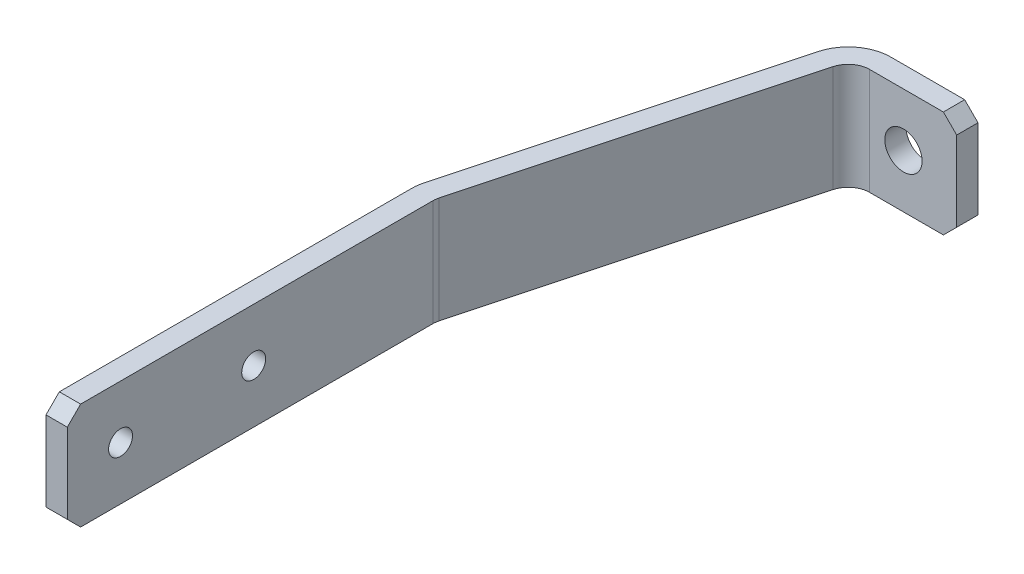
ISO-10303-21;
HEADER;
FILE_DESCRIPTION(('STEP AP214'),'2;1');
FILE_NAME('part.step','',(''),(''),'','','');
FILE_SCHEMA(('AUTOMOTIVE_DESIGN { 1 0 10303 214 1 1 1 1 }'));
ENDSEC;
DATA;
#1=APPLICATION_CONTEXT('core data for automotive mechanical design processes');
#2=APPLICATION_PROTOCOL_DEFINITION('international standard','automotive_design',2000,#1);
#3=PRODUCT_CONTEXT('',#1,'mechanical');
#4=PRODUCT('Part','Part','',(#3));
#5=PRODUCT_RELATED_PRODUCT_CATEGORY('part','',(#4));
#6=PRODUCT_DEFINITION_FORMATION('','',#4);
#7=PRODUCT_DEFINITION_CONTEXT('part definition',#1,'design');
#8=PRODUCT_DEFINITION('design','',#6,#7);
#9=PRODUCT_DEFINITION_SHAPE('','',#8);
#10=(LENGTH_UNIT() NAMED_UNIT(*) SI_UNIT(.MILLI.,.METRE.));
#11=(NAMED_UNIT(*) PLANE_ANGLE_UNIT() SI_UNIT($,.RADIAN.));
#12=(NAMED_UNIT(*) SI_UNIT($,.STERADIAN.) SOLID_ANGLE_UNIT());
#13=UNCERTAINTY_MEASURE_WITH_UNIT(LENGTH_MEASURE(1.E-05),#10,'distance_accuracy_value','');
#14=(GEOMETRIC_REPRESENTATION_CONTEXT(3) GLOBAL_UNCERTAINTY_ASSIGNED_CONTEXT((#13)) GLOBAL_UNIT_ASSIGNED_CONTEXT((#10,
#11,#12)) REPRESENTATION_CONTEXT('',''));
#15=CARTESIAN_POINT('',(0.,0.,0.));
#16=DIRECTION('',(0.,0.,1.));
#17=DIRECTION('',(1.,0.,0.));
#18=AXIS2_PLACEMENT_3D('',#15,#16,#17);
#19=CARTESIAN_POINT('',(80.,20.,8.));
#20=DIRECTION('',(1.,0.,0.));
#21=DIRECTION('',(0.,0.,-1.));
#22=AXIS2_PLACEMENT_3D('',#19,#20,#21);
#23=PLANE('',#22);
#24=DIRECTION('',(0.,0.,1.));
#25=VECTOR('',#24,1.);
#26=CARTESIAN_POINT('',(80.,15.,7.5));
#27=LINE('',#26,#25);
#28=CARTESIAN_POINT('',(80.,15.,8.));
#29=VERTEX_POINT('',#28);
#30=CARTESIAN_POINT('',(80.,15.,0.));
#31=VERTEX_POINT('',#30);
#32=EDGE_CURVE('E264',#29,#31,#27,.F.);
#33=ORIENTED_EDGE('',*,*,#32,.F.);
#34=DIRECTION('',(0.,1.,0.));
#35=VECTOR('',#34,1.);
#36=CARTESIAN_POINT('',(80.,20.,8.));
#37=LINE('',#36,#35);
#38=CARTESIAN_POINT('',(80.,-15.,8.));
#39=VERTEX_POINT('',#38);
#40=EDGE_CURVE('E255',#39,#29,#37,.T.);
#41=ORIENTED_EDGE('',*,*,#40,.F.);
#42=DIRECTION('',(0.,0.,1.));
#43=VECTOR('',#42,1.);
#44=CARTESIAN_POINT('',(80.,-15.,7.5));
#45=LINE('',#44,#43);
#46=CARTESIAN_POINT('',(80.,-15.,0.));
#47=VERTEX_POINT('',#46);
#48=EDGE_CURVE('E256',#47,#39,#45,.T.);
#49=ORIENTED_EDGE('',*,*,#48,.F.);
#50=DIRECTION('',(0.,1.,0.));
#51=VECTOR('',#50,1.);
#52=CARTESIAN_POINT('',(80.,20.,0.));
#53=LINE('',#52,#51);
#54=EDGE_CURVE('E259',#31,#47,#53,.F.);
#55=ORIENTED_EDGE('',*,*,#54,.F.);
#56=EDGE_LOOP('',(#33,#41,#49,#55));
#57=FACE_BOUND('',#56,.T.);
#58=ADVANCED_FACE('F15',(#57),#23,.T.);
#59=CARTESIAN_POINT('',(60.,0.,4.));
#60=DIRECTION('',(0.,0.,1.));
#61=DIRECTION('',(1.,0.,0.));
#62=AXIS2_PLACEMENT_3D('',#59,#60,#61);
#63=CYLINDRICAL_SURFACE('',#62,7.);
#64=CARTESIAN_POINT('',(60.,0.,0.));
#65=DIRECTION('',(0.,0.,1.));
#66=DIRECTION('',(1.,0.,0.));
#67=AXIS2_PLACEMENT_3D('',#64,#65,#66);
#68=CIRCLE('',#67,7.);
#69=CARTESIAN_POINT('',(53.,0.,0.));
#70=VERTEX_POINT('',#69);
#71=EDGE_CURVE('E34',#70,#70,#68,.T.);
#72=ORIENTED_EDGE('',*,*,#71,.F.);
#73=EDGE_LOOP('',(#72));
#74=FACE_BOUND('',#73,.T.);
#75=CARTESIAN_POINT('',(60.,0.,8.));
#76=DIRECTION('',(0.,0.,1.));
#77=DIRECTION('',(1.,0.,0.));
#78=AXIS2_PLACEMENT_3D('',#75,#76,#77);
#79=CIRCLE('',#78,7.);
#80=CARTESIAN_POINT('',(53.,0.,8.));
#81=VERTEX_POINT('',#80);
#82=EDGE_CURVE('E18',#81,#81,#79,.F.);
#83=ORIENTED_EDGE('',*,*,#82,.F.);
#84=EDGE_LOOP('',(#83));
#85=FACE_BOUND('',#84,.T.);
#86=ADVANCED_FACE('F495',(#74,#85),#63,.F.);
#87=CARTESIAN_POINT('',(80.,15.,7.5));
#88=DIRECTION('',(0.70710678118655,0.707106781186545,0.));
#89=DIRECTION('',(-0.707106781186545,0.70710678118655,0.));
#90=AXIS2_PLACEMENT_3D('',#87,#88,#89);
#91=PLANE('',#90);
#92=ORIENTED_EDGE('',*,*,#32,.T.);
#93=DIRECTION('',(0.707106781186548,-0.707106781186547,0.));
#94=VECTOR('',#93,1.);
#95=CARTESIAN_POINT('',(75.,20.,0.));
#96=LINE('',#95,#94);
#97=CARTESIAN_POINT('',(75.,20.,0.));
#98=VERTEX_POINT('',#97);
#99=EDGE_CURVE('E229',#98,#31,#96,.T.);
#100=ORIENTED_EDGE('',*,*,#99,.F.);
#101=DIRECTION('',(0.,0.,-1.));
#102=VECTOR('',#101,1.);
#103=CARTESIAN_POINT('',(75.,20.,119.583065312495));
#104=LINE('',#103,#102);
#105=CARTESIAN_POINT('',(75.,20.,8.00000000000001));
#106=VERTEX_POINT('',#105);
#107=EDGE_CURVE('E200',#98,#106,#104,.F.);
#108=ORIENTED_EDGE('',*,*,#107,.T.);
#109=DIRECTION('',(-0.707106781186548,0.707106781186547,0.));
#110=VECTOR('',#109,1.);
#111=CARTESIAN_POINT('',(80.,15.,8.));
#112=LINE('',#111,#110);
#113=EDGE_CURVE('E262',#29,#106,#112,.T.);
#114=ORIENTED_EDGE('',*,*,#113,.F.);
#115=EDGE_LOOP('',(#92,#100,#108,#114));
#116=FACE_BOUND('',#115,.T.);
#117=ADVANCED_FACE('F308',(#116),#91,.T.);
#118=CARTESIAN_POINT('',(80.,-15.,7.5));
#119=DIRECTION('',(0.707106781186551,-0.707106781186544,0.));
#120=DIRECTION('',(0.707106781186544,0.707106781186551,0.));
#121=AXIS2_PLACEMENT_3D('',#118,#119,#120);
#122=PLANE('',#121);
#123=ORIENTED_EDGE('',*,*,#48,.T.);
#124=DIRECTION('',(0.707106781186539,0.707106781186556,0.));
#125=VECTOR('',#124,1.);
#126=CARTESIAN_POINT('',(75.0000000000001,-20.,8.));
#127=LINE('',#126,#125);
#128=CARTESIAN_POINT('',(75.0000000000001,-20.,8.00000000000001));
#129=VERTEX_POINT('',#128);
#130=EDGE_CURVE('E252',#129,#39,#127,.T.);
#131=ORIENTED_EDGE('',*,*,#130,.F.);
#132=DIRECTION('',(0.,0.,-1.));
#133=VECTOR('',#132,1.);
#134=CARTESIAN_POINT('',(75.0000000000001,-20.,119.583065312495));
#135=LINE('',#134,#133);
#136=CARTESIAN_POINT('',(75.0000000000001,-20.,0.));
#137=VERTEX_POINT('',#136);
#138=EDGE_CURVE('E234',#137,#129,#135,.F.);
#139=ORIENTED_EDGE('',*,*,#138,.F.);
#140=DIRECTION('',(-0.707106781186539,-0.707106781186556,0.));
#141=VECTOR('',#140,1.);
#142=CARTESIAN_POINT('',(80.,-15.,0.));
#143=LINE('',#142,#141);
#144=EDGE_CURVE('E230',#47,#137,#143,.T.);
#145=ORIENTED_EDGE('',*,*,#144,.F.);
#146=EDGE_LOOP('',(#123,#131,#139,#145));
#147=FACE_BOUND('',#146,.T.);
#148=ADVANCED_FACE('F315',(#147),#122,.T.);
#149=CARTESIAN_POINT('',(47.27723017,20.,8.));
#150=DIRECTION('',(0.,0.,1.));
#151=DIRECTION('',(1.,0.,0.));
#152=AXIS2_PLACEMENT_3D('',#149,#150,#151);
#153=PLANE('',#152);
#154=ORIENTED_EDGE('',*,*,#82,.T.);
#155=EDGE_LOOP('',(#154));
#156=FACE_BOUND('',#155,.T.);
#157=DIRECTION('',(0.,1.,0.));
#158=VECTOR('',#157,1.);
#159=CARTESIAN_POINT('',(47.27723017,20.,7.99999999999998));
#160=LINE('',#159,#158);
#161=CARTESIAN_POINT('',(47.2772301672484,20.,7.99999999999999));
#162=VERTEX_POINT('',#161);
#163=CARTESIAN_POINT('',(47.2772301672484,-20.,7.99999999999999));
#164=VERTEX_POINT('',#163);
#165=EDGE_CURVE('E250',#162,#164,#160,.F.);
#166=ORIENTED_EDGE('',*,*,#165,.T.);
#167=DIRECTION('',(1.,0.,0.));
#168=VECTOR('',#167,1.);
#169=CARTESIAN_POINT('',(18.9645059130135,-20.,8.00000000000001));
#170=LINE('',#169,#168);
#171=EDGE_CURVE('E237',#129,#164,#170,.F.);
#172=ORIENTED_EDGE('',*,*,#171,.F.);
#173=ORIENTED_EDGE('',*,*,#130,.T.);
#174=ORIENTED_EDGE('',*,*,#40,.T.);
#175=ORIENTED_EDGE('',*,*,#113,.T.);
#176=DIRECTION('',(1.,0.,0.));
#177=VECTOR('',#176,1.);
#178=CARTESIAN_POINT('',(18.9645059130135,20.,8.00000000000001));
#179=LINE('',#178,#177);
#180=EDGE_CURVE('E212',#106,#162,#179,.F.);
#181=ORIENTED_EDGE('',*,*,#180,.T.);
#182=EDGE_LOOP('',(#166,#172,#173,#174,#175,#181));
#183=FACE_BOUND('',#182,.T.);
#184=ADVANCED_FACE('F353',(#156,#183),#153,.T.);
#185=CARTESIAN_POINT('',(47.2772301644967,20.,15.9999999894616));
#186=DIRECTION('',(0.,1.,0.));
#187=DIRECTION('',(0.,0.,1.));
#188=AXIS2_PLACEMENT_3D('',#185,#186,#187);
#189=CYLINDRICAL_SURFACE('',#188,7.99999998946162);
#190=ORIENTED_EDGE('',*,*,#165,.F.);
#191=CARTESIAN_POINT('',(47.2772301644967,20.,15.9999999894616));
#192=DIRECTION('',(0.,1.,0.));
#193=DIRECTION('',(0.,0.,1.));
#194=AXIS2_PLACEMENT_3D('',#191,#192,#193);
#195=CIRCLE('',#194,7.99999998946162);
#196=CARTESIAN_POINT('',(39.5498238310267,20.,13.9294466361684));
#197=VERTEX_POINT('',#196);
#198=EDGE_CURVE('E211',#162,#197,#195,.T.);
#199=ORIENTED_EDGE('',*,*,#198,.T.);
#200=DIRECTION('',(0.,1.,0.));
#201=VECTOR('',#200,1.);
#202=CARTESIAN_POINT('',(39.5498238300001,20.,13.92944664));
#203=LINE('',#202,#201);
#204=CARTESIAN_POINT('',(39.5498238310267,-20.,13.9294466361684));
#205=VERTEX_POINT('',#204);
#206=EDGE_CURVE('E247',#205,#197,#203,.T.);
#207=ORIENTED_EDGE('',*,*,#206,.F.);
#208=CARTESIAN_POINT('',(47.2772301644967,-20.,15.9999999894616));
#209=DIRECTION('',(0.,1.,0.));
#210=DIRECTION('',(0.,0.,1.));
#211=AXIS2_PLACEMENT_3D('',#208,#209,#210);
#212=CIRCLE('',#211,7.99999998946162);
#213=EDGE_CURVE('E290',#164,#205,#212,.T.);
#214=ORIENTED_EDGE('',*,*,#213,.F.);
#215=EDGE_LOOP('',(#190,#199,#207,#214));
#216=FACE_BOUND('',#215,.T.);
#217=ADVANCED_FACE('F357',(#216),#189,.F.);
#218=CARTESIAN_POINT('',(8.27259366,20.,130.65759839));
#219=DIRECTION('',(0.965925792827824,0.,0.258819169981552));
#220=DIRECTION('',(0.258819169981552,0.,-0.965925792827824));
#221=AXIS2_PLACEMENT_3D('',#218,#219,#220);
#222=PLANE('',#221);
#223=DIRECTION('',(-0.258819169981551,0.,0.965925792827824));
#224=VECTOR('',#223,1.);
#225=CARTESIAN_POINT('',(39.54982383,20.,13.92944664));
#226=LINE('',#225,#224);
#227=CARTESIAN_POINT('',(8.2725936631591,20.,130.65759837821));
#228=VERTEX_POINT('',#227);
#229=EDGE_CURVE('E209',#197,#228,#226,.T.);
#230=ORIENTED_EDGE('',*,*,#229,.T.);
#231=DIRECTION('',(0.,1.,0.));
#232=VECTOR('',#231,1.);
#233=CARTESIAN_POINT('',(8.27259366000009,20.,130.65759839));
#234=LINE('',#233,#232);
#235=CARTESIAN_POINT('',(8.27259366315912,-20.,130.65759837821));
#236=VERTEX_POINT('',#235);
#237=EDGE_CURVE('E241',#228,#236,#234,.F.);
#238=ORIENTED_EDGE('',*,*,#237,.T.);
#239=DIRECTION('',(-0.258819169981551,0.,0.965925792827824));
#240=VECTOR('',#239,1.);
#241=CARTESIAN_POINT('',(39.54982383,-20.,13.92944664));
#242=LINE('',#241,#240);
#243=EDGE_CURVE('E289',#205,#236,#242,.T.);
#244=ORIENTED_EDGE('',*,*,#243,.F.);
#245=ORIENTED_EDGE('',*,*,#206,.T.);
#246=EDGE_LOOP('',(#230,#238,#244,#245));
#247=FACE_BOUND('',#246,.T.);
#248=ADVANCED_FACE('F360',(#247),#222,.T.);
#249=CARTESIAN_POINT('',(16.0000002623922,20.,132.728151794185));
#250=DIRECTION('',(0.,1.,0.));
#251=DIRECTION('',(0.,0.,1.));
#252=AXIS2_PLACEMENT_3D('',#249,#250,#251);
#253=CYLINDRICAL_SURFACE('',#252,8.00000026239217);
#254=ORIENTED_EDGE('',*,*,#237,.F.);
#255=CARTESIAN_POINT('',(16.0000002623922,20.,132.728151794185));
#256=DIRECTION('',(0.,1.,0.));
#257=DIRECTION('',(0.,0.,1.));
#258=AXIS2_PLACEMENT_3D('',#255,#256,#257);
#259=CIRCLE('',#258,8.00000026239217);
#260=CARTESIAN_POINT('',(8.00000000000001,20.,132.728151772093));
#261=VERTEX_POINT('',#260);
#262=EDGE_CURVE('E208',#228,#261,#259,.T.);
#263=ORIENTED_EDGE('',*,*,#262,.T.);
#264=DIRECTION('',(0.,1.,0.));
#265=VECTOR('',#264,1.);
#266=CARTESIAN_POINT('',(8.,20.,132.72815175));
#267=LINE('',#266,#265);
#268=CARTESIAN_POINT('',(8.00000000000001,-20.,132.728151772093));
#269=VERTEX_POINT('',#268);
#270=EDGE_CURVE('E221',#269,#261,#267,.T.);
#271=ORIENTED_EDGE('',*,*,#270,.F.);
#272=CARTESIAN_POINT('',(16.0000002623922,-20.,132.728151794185));
#273=DIRECTION('',(0.,1.,0.));
#274=DIRECTION('',(0.,0.,1.));
#275=AXIS2_PLACEMENT_3D('',#272,#273,#274);
#276=CIRCLE('',#275,8.00000026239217);
#277=EDGE_CURVE('E286',#236,#269,#276,.T.);
#278=ORIENTED_EDGE('',*,*,#277,.F.);
#279=EDGE_LOOP('',(#254,#263,#271,#278));
#280=FACE_BOUND('',#279,.T.);
#281=ADVANCED_FACE('F364',(#280),#253,.F.);
#282=CARTESIAN_POINT('',(31.82241748,20.,11.85889328));
#283=DIRECTION('',(-0.965925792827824,0.,-0.258819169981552));
#284=DIRECTION('',(-0.258819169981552,0.,0.965925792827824));
#285=AXIS2_PLACEMENT_3D('',#282,#283,#284);
#286=PLANE('',#285);
#287=DIRECTION('',(0.258819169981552,0.,-0.965925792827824));
#288=VECTOR('',#287,1.);
#289=CARTESIAN_POINT('',(0.545187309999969,20.,128.58704503));
#290=LINE('',#289,#288);
#291=CARTESIAN_POINT('',(0.545187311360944,20.,128.587045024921));
#292=VERTEX_POINT('',#291);
#293=CARTESIAN_POINT('',(31.8224174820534,20.,11.8588932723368));
#294=VERTEX_POINT('',#293);
#295=EDGE_CURVE('E202',#292,#294,#290,.T.);
#296=ORIENTED_EDGE('',*,*,#295,.T.);
#297=DIRECTION('',(0.,1.,0.));
#298=VECTOR('',#297,1.);
#299=CARTESIAN_POINT('',(31.82241748,20.,11.85889328));
#300=LINE('',#299,#298);
#301=CARTESIAN_POINT('',(31.8224174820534,-20.,11.8588932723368));
#302=VERTEX_POINT('',#301);
#303=EDGE_CURVE('E233',#302,#294,#300,.T.);
#304=ORIENTED_EDGE('',*,*,#303,.F.);
#305=DIRECTION('',(0.258819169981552,0.,-0.965925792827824));
#306=VECTOR('',#305,1.);
#307=CARTESIAN_POINT('',(0.545187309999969,-20.,128.58704503));
#308=LINE('',#307,#306);
#309=CARTESIAN_POINT('',(0.545187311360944,-20.,128.587045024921));
#310=VERTEX_POINT('',#309);
#311=EDGE_CURVE('E281',#310,#302,#308,.T.);
#312=ORIENTED_EDGE('',*,*,#311,.F.);
#313=DIRECTION('',(0.,1.,0.));
#314=VECTOR('',#313,1.);
#315=CARTESIAN_POINT('',(0.545187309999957,20.,128.58704503));
#316=LINE('',#315,#314);
#317=EDGE_CURVE('E238',#292,#310,#316,.F.);
#318=ORIENTED_EDGE('',*,*,#317,.F.);
#319=EDGE_LOOP('',(#296,#304,#312,#318));
#320=FACE_BOUND('',#319,.T.);
#321=ADVANCED_FACE('F347',(#320),#286,.T.);
#322=CARTESIAN_POINT('',(47.2772301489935,20.,15.9999999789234));
#323=DIRECTION('',(0.,1.,0.));
#324=DIRECTION('',(0.,0.,1.));
#325=AXIS2_PLACEMENT_3D('',#322,#323,#324);
#326=CYLINDRICAL_SURFACE('',#325,15.9999999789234);
#327=CARTESIAN_POINT('',(47.2772301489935,20.,15.9999999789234));
#328=DIRECTION('',(0.,1.,0.));
#329=DIRECTION('',(0.,0.,1.));
#330=AXIS2_PLACEMENT_3D('',#327,#328,#329);
#331=CIRCLE('',#330,15.9999999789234);
#332=CARTESIAN_POINT('',(47.2772301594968,20.,0.));
#333=VERTEX_POINT('',#332);
#334=EDGE_CURVE('E201',#294,#333,#331,.F.);
#335=ORIENTED_EDGE('',*,*,#334,.T.);
#336=DIRECTION('',(0.,1.,0.));
#337=VECTOR('',#336,1.);
#338=CARTESIAN_POINT('',(47.27723017,20.,0.));
#339=LINE('',#338,#337);
#340=CARTESIAN_POINT('',(47.2772301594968,-20.,0.));
#341=VERTEX_POINT('',#340);
#342=EDGE_CURVE('E226',#341,#333,#339,.T.);
#343=ORIENTED_EDGE('',*,*,#342,.F.);
#344=CARTESIAN_POINT('',(47.2772301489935,-20.,15.9999999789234));
#345=DIRECTION('',(0.,1.,0.));
#346=DIRECTION('',(0.,0.,1.));
#347=AXIS2_PLACEMENT_3D('',#344,#345,#346);
#348=CIRCLE('',#347,15.9999999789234);
#349=EDGE_CURVE('E278',#302,#341,#348,.F.);
#350=ORIENTED_EDGE('',*,*,#349,.F.);
#351=ORIENTED_EDGE('',*,*,#303,.T.);
#352=EDGE_LOOP('',(#335,#343,#350,#351));
#353=FACE_BOUND('',#352,.T.);
#354=ADVANCED_FACE('F302',(#353),#326,.T.);
#355=CARTESIAN_POINT('',(80.,20.,0.));
#356=DIRECTION('',(0.,0.,-1.));
#357=DIRECTION('',(-1.,0.,0.));
#358=AXIS2_PLACEMENT_3D('',#355,#356,#357);
#359=PLANE('',#358);
#360=ORIENTED_EDGE('',*,*,#71,.T.);
#361=EDGE_LOOP('',(#360));
#362=FACE_BOUND('',#361,.T.);
#363=ORIENTED_EDGE('',*,*,#99,.T.);
#364=ORIENTED_EDGE('',*,*,#54,.T.);
#365=ORIENTED_EDGE('',*,*,#144,.T.);
#366=DIRECTION('',(1.,0.,0.));
#367=VECTOR('',#366,1.);
#368=CARTESIAN_POINT('',(18.9645059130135,-20.,0.));
#369=LINE('',#368,#367);
#370=EDGE_CURVE('E191',#341,#137,#369,.T.);
#371=ORIENTED_EDGE('',*,*,#370,.F.);
#372=ORIENTED_EDGE('',*,*,#342,.T.);
#373=DIRECTION('',(1.,0.,0.));
#374=VECTOR('',#373,1.);
#375=CARTESIAN_POINT('',(18.9645059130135,20.,0.));
#376=LINE('',#375,#374);
#377=EDGE_CURVE('E197',#333,#98,#376,.T.);
#378=ORIENTED_EDGE('',*,*,#377,.T.);
#379=EDGE_LOOP('',(#363,#364,#365,#371,#372,#378));
#380=FACE_BOUND('',#379,.T.);
#381=ADVANCED_FACE('F298',(#362,#380),#359,.T.);
#382=CARTESIAN_POINT('',(8.,20.,270.));
#383=DIRECTION('',(1.,0.,0.));
#384=DIRECTION('',(0.,0.,-1.));
#385=AXIS2_PLACEMENT_3D('',#382,#383,#384);
#386=PLANE('',#385);
#387=CARTESIAN_POINT('',(8.,0.,250.));
#388=DIRECTION('',(1.,0.,0.));
#389=DIRECTION('',(0.,0.,-1.));
#390=AXIS2_PLACEMENT_3D('',#387,#388,#389);
#391=CIRCLE('',#390,4.5);
#392=CARTESIAN_POINT('',(8.,4.5,250.));
#393=VERTEX_POINT('',#392);
#394=EDGE_CURVE('E224',#393,#393,#391,.F.);
#395=ORIENTED_EDGE('',*,*,#394,.T.);
#396=EDGE_LOOP('',(#395));
#397=FACE_BOUND('',#396,.T.);
#398=CARTESIAN_POINT('',(8.,0.,200.));
#399=DIRECTION('',(1.,0.,0.));
#400=DIRECTION('',(0.,0.,-1.));
#401=AXIS2_PLACEMENT_3D('',#398,#399,#400);
#402=CIRCLE('',#401,4.5);
#403=CARTESIAN_POINT('',(8.,4.5,200.));
#404=VERTEX_POINT('',#403);
#405=EDGE_CURVE('E217',#404,#404,#402,.F.);
#406=ORIENTED_EDGE('',*,*,#405,.T.);
#407=EDGE_LOOP('',(#406));
#408=FACE_BOUND('',#407,.T.);
#409=ORIENTED_EDGE('',*,*,#270,.T.);
#410=DIRECTION('',(0.,0.,-1.));
#411=VECTOR('',#410,1.);
#412=CARTESIAN_POINT('',(8.00000000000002,20.,119.583065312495));
#413=LINE('',#412,#411);
#414=CARTESIAN_POINT('',(8.00000000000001,20.,265.));
#415=VERTEX_POINT('',#414);
#416=EDGE_CURVE('E205',#261,#415,#413,.F.);
#417=ORIENTED_EDGE('',*,*,#416,.T.);
#418=DIRECTION('',(0.,-0.70710678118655,0.707106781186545));
#419=VECTOR('',#418,1.);
#420=CARTESIAN_POINT('',(8.,15.,270.));
#421=LINE('',#420,#419);
#422=CARTESIAN_POINT('',(8.,15.,270.));
#423=VERTEX_POINT('',#422);
#424=EDGE_CURVE('E214',#423,#415,#421,.F.);
#425=ORIENTED_EDGE('',*,*,#424,.F.);
#426=DIRECTION('',(0.,1.,0.));
#427=VECTOR('',#426,1.);
#428=CARTESIAN_POINT('',(8.,20.,270.));
#429=LINE('',#428,#427);
#430=CARTESIAN_POINT('',(8.,-15.,270.));
#431=VERTEX_POINT('',#430);
#432=EDGE_CURVE('E165',#431,#423,#429,.T.);
#433=ORIENTED_EDGE('',*,*,#432,.F.);
#434=DIRECTION('',(0.,-0.70710678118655,-0.707106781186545));
#435=VECTOR('',#434,1.);
#436=CARTESIAN_POINT('',(8.,-15.,270.));
#437=LINE('',#436,#435);
#438=CARTESIAN_POINT('',(8.00000000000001,-20.,265.));
#439=VERTEX_POINT('',#438);
#440=EDGE_CURVE('E160',#439,#431,#437,.F.);
#441=ORIENTED_EDGE('',*,*,#440,.F.);
#442=DIRECTION('',(0.,0.,-1.));
#443=VECTOR('',#442,1.);
#444=CARTESIAN_POINT('',(8.00000000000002,-20.,119.583065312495));
#445=LINE('',#444,#443);
#446=EDGE_CURVE('E285',#269,#439,#445,.F.);
#447=ORIENTED_EDGE('',*,*,#446,.F.);
#448=EDGE_LOOP('',(#409,#417,#425,#433,#441,#447));
#449=FACE_BOUND('',#448,.T.);
#450=ADVANCED_FACE('F301',(#397,#408,#449),#386,.T.);
#451=CARTESIAN_POINT('',(7.5,15.,270.));
#452=DIRECTION('',(0.,0.707106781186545,0.70710678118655));
#453=DIRECTION('',(0.,-0.70710678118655,0.707106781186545));
#454=AXIS2_PLACEMENT_3D('',#451,#452,#453);
#455=PLANE('',#454);
#456=DIRECTION('',(1.,0.,0.));
#457=VECTOR('',#456,1.);
#458=CARTESIAN_POINT('',(0.,15.,270.));
#459=LINE('',#458,#457);
#460=CARTESIAN_POINT('',(0.,15.,270.));
#461=VERTEX_POINT('',#460);
#462=EDGE_CURVE('E166',#423,#461,#459,.F.);
#463=ORIENTED_EDGE('',*,*,#462,.F.);
#464=ORIENTED_EDGE('',*,*,#424,.T.);
#465=DIRECTION('',(1.,0.,0.));
#466=VECTOR('',#465,1.);
#467=CARTESIAN_POINT('',(18.9645059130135,20.,265.));
#468=LINE('',#467,#466);
#469=CARTESIAN_POINT('',(0.,20.,265.));
#470=VERTEX_POINT('',#469);
#471=EDGE_CURVE('E204',#415,#470,#468,.F.);
#472=ORIENTED_EDGE('',*,*,#471,.T.);
#473=DIRECTION('',(0.,0.707106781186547,-0.707106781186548));
#474=VECTOR('',#473,1.);
#475=CARTESIAN_POINT('',(0.,15.,270.));
#476=LINE('',#475,#474);
#477=EDGE_CURVE('E196',#461,#470,#476,.T.);
#478=ORIENTED_EDGE('',*,*,#477,.F.);
#479=EDGE_LOOP('',(#463,#464,#472,#478));
#480=FACE_BOUND('',#479,.T.);
#481=ADVANCED_FACE('F342',(#480),#455,.T.);
#482=CARTESIAN_POINT('',(18.9645059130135,20.,119.583065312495));
#483=DIRECTION('',(0.,-1.,0.));
#484=DIRECTION('',(0.,0.,-1.));
#485=AXIS2_PLACEMENT_3D('',#482,#483,#484);
#486=PLANE('',#485);
#487=ORIENTED_EDGE('',*,*,#377,.F.);
#488=ORIENTED_EDGE('',*,*,#334,.F.);
#489=ORIENTED_EDGE('',*,*,#295,.F.);
#490=CARTESIAN_POINT('',(15.9999999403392,20.,132.728151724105));
#491=DIRECTION('',(0.,1.,0.));
#492=DIRECTION('',(0.,0.,1.));
#493=AXIS2_PLACEMENT_3D('',#490,#491,#492);
#494=CIRCLE('',#493,15.9999999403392);
#495=CARTESIAN_POINT('',(0.,20.,132.728151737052));
#496=VERTEX_POINT('',#495);
#497=EDGE_CURVE('E243',#496,#292,#494,.F.);
#498=ORIENTED_EDGE('',*,*,#497,.F.);
#499=DIRECTION('',(0.,0.,1.));
#500=VECTOR('',#499,1.);
#501=CARTESIAN_POINT('',(0.,20.,132.72815175));
#502=LINE('',#501,#500);
#503=EDGE_CURVE('E192',#470,#496,#502,.F.);
#504=ORIENTED_EDGE('',*,*,#503,.F.);
#505=ORIENTED_EDGE('',*,*,#471,.F.);
#506=ORIENTED_EDGE('',*,*,#416,.F.);
#507=ORIENTED_EDGE('',*,*,#262,.F.);
#508=ORIENTED_EDGE('',*,*,#229,.F.);
#509=ORIENTED_EDGE('',*,*,#198,.F.);
#510=ORIENTED_EDGE('',*,*,#180,.F.);
#511=ORIENTED_EDGE('',*,*,#107,.F.);
#512=EDGE_LOOP('',(#487,#488,#489,#498,#504,#505,#506,#507,#508,#509,#510,#511));
#513=FACE_BOUND('',#512,.T.);
#514=ADVANCED_FACE('F344',(#513),#486,.F.);
#515=CARTESIAN_POINT('',(15.9999999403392,20.,132.728151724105));
#516=DIRECTION('',(0.,1.,0.));
#517=DIRECTION('',(0.,0.,1.));
#518=AXIS2_PLACEMENT_3D('',#515,#516,#517);
#519=CYLINDRICAL_SURFACE('',#518,15.9999999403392);
#520=ORIENTED_EDGE('',*,*,#497,.T.);
#521=ORIENTED_EDGE('',*,*,#317,.T.);
#522=CARTESIAN_POINT('',(15.9999999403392,-20.,132.728151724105));
#523=DIRECTION('',(0.,1.,0.));
#524=DIRECTION('',(0.,0.,1.));
#525=AXIS2_PLACEMENT_3D('',#522,#523,#524);
#526=CIRCLE('',#525,15.9999999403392);
#527=CARTESIAN_POINT('',(0.,-20.,132.728151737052));
#528=VERTEX_POINT('',#527);
#529=EDGE_CURVE('E282',#528,#310,#526,.F.);
#530=ORIENTED_EDGE('',*,*,#529,.F.);
#531=DIRECTION('',(0.,1.,0.));
#532=VECTOR('',#531,1.);
#533=CARTESIAN_POINT('',(0.,20.,132.72815175));
#534=LINE('',#533,#532);
#535=EDGE_CURVE('E185',#496,#528,#534,.F.);
#536=ORIENTED_EDGE('',*,*,#535,.F.);
#537=EDGE_LOOP('',(#520,#521,#530,#536));
#538=FACE_BOUND('',#537,.T.);
#539=ADVANCED_FACE('F333',(#538),#519,.T.);
#540=CARTESIAN_POINT('',(18.9645059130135,-20.,119.583065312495));
#541=DIRECTION('',(0.,-1.,0.));
#542=DIRECTION('',(0.,0.,-1.));
#543=AXIS2_PLACEMENT_3D('',#540,#541,#542);
#544=PLANE('',#543);
#545=ORIENTED_EDGE('',*,*,#349,.T.);
#546=ORIENTED_EDGE('',*,*,#370,.T.);
#547=ORIENTED_EDGE('',*,*,#138,.T.);
#548=ORIENTED_EDGE('',*,*,#171,.T.);
#549=ORIENTED_EDGE('',*,*,#213,.T.);
#550=ORIENTED_EDGE('',*,*,#243,.T.);
#551=ORIENTED_EDGE('',*,*,#277,.T.);
#552=ORIENTED_EDGE('',*,*,#446,.T.);
#553=DIRECTION('',(1.,0.,0.));
#554=VECTOR('',#553,1.);
#555=CARTESIAN_POINT('',(7.5,-20.,265.));
#556=LINE('',#555,#554);
#557=CARTESIAN_POINT('',(0.,-20.,265.));
#558=VERTEX_POINT('',#557);
#559=EDGE_CURVE('E189',#558,#439,#556,.T.);
#560=ORIENTED_EDGE('',*,*,#559,.F.);
#561=DIRECTION('',(0.,0.,1.));
#562=VECTOR('',#561,1.);
#563=CARTESIAN_POINT('',(0.,-20.,132.72815175));
#564=LINE('',#563,#562);
#565=EDGE_CURVE('E180',#528,#558,#564,.T.);
#566=ORIENTED_EDGE('',*,*,#565,.F.);
#567=ORIENTED_EDGE('',*,*,#529,.T.);
#568=ORIENTED_EDGE('',*,*,#311,.T.);
#569=EDGE_LOOP('',(#545,#546,#547,#548,#549,#550,#551,#552,#560,#566,#567,#568));
#570=FACE_BOUND('',#569,.T.);
#571=ADVANCED_FACE('F319',(#570),#544,.T.);
#572=CARTESIAN_POINT('',(7.5,-15.,270.));
#573=DIRECTION('',(0.,-0.707106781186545,0.70710678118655));
#574=DIRECTION('',(0.,-0.70710678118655,-0.707106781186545));
#575=AXIS2_PLACEMENT_3D('',#572,#573,#574);
#576=PLANE('',#575);
#577=ORIENTED_EDGE('',*,*,#559,.T.);
#578=ORIENTED_EDGE('',*,*,#440,.T.);
#579=DIRECTION('',(1.,0.,0.));
#580=VECTOR('',#579,1.);
#581=CARTESIAN_POINT('',(0.,-15.,270.));
#582=LINE('',#581,#580);
#583=CARTESIAN_POINT('',(0.,-15.,270.));
#584=VERTEX_POINT('',#583);
#585=EDGE_CURVE('E152',#584,#431,#582,.T.);
#586=ORIENTED_EDGE('',*,*,#585,.F.);
#587=DIRECTION('',(0.,0.707106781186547,0.707106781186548));
#588=VECTOR('',#587,1.);
#589=CARTESIAN_POINT('',(0.,-20.,265.));
#590=LINE('',#589,#588);
#591=EDGE_CURVE('E157',#558,#584,#590,.T.);
#592=ORIENTED_EDGE('',*,*,#591,.F.);
#593=EDGE_LOOP('',(#577,#578,#586,#592));
#594=FACE_BOUND('',#593,.T.);
#595=ADVANCED_FACE('F155',(#594),#576,.T.);
#596=CARTESIAN_POINT('',(0.,20.,270.));
#597=DIRECTION('',(0.,0.,1.));
#598=DIRECTION('',(1.,0.,0.));
#599=AXIS2_PLACEMENT_3D('',#596,#597,#598);
#600=PLANE('',#599);
#601=ORIENTED_EDGE('',*,*,#585,.T.);
#602=ORIENTED_EDGE('',*,*,#432,.T.);
#603=ORIENTED_EDGE('',*,*,#462,.T.);
#604=DIRECTION('',(0.,1.,0.));
#605=VECTOR('',#604,1.);
#606=CARTESIAN_POINT('',(0.,20.,270.));
#607=LINE('',#606,#605);
#608=EDGE_CURVE('E170',#584,#461,#607,.T.);
#609=ORIENTED_EDGE('',*,*,#608,.F.);
#610=EDGE_LOOP('',(#601,#602,#603,#609));
#611=FACE_BOUND('',#610,.T.);
#612=ADVANCED_FACE('F171',(#611),#600,.T.);
#613=CARTESIAN_POINT('',(4.,0.,250.));
#614=DIRECTION('',(1.,0.,0.));
#615=DIRECTION('',(0.,0.,-1.));
#616=AXIS2_PLACEMENT_3D('',#613,#614,#615);
#617=CYLINDRICAL_SURFACE('',#616,4.5);
#618=CARTESIAN_POINT('',(0.,0.,250.));
#619=DIRECTION('',(1.,0.,0.));
#620=DIRECTION('',(0.,0.,-1.));
#621=AXIS2_PLACEMENT_3D('',#618,#619,#620);
#622=CIRCLE('',#621,4.5);
#623=CARTESIAN_POINT('',(0.,4.5,250.));
#624=VERTEX_POINT('',#623);
#625=EDGE_CURVE('E24',#624,#624,#622,.T.);
#626=ORIENTED_EDGE('',*,*,#625,.F.);
#627=EDGE_LOOP('',(#626));
#628=FACE_BOUND('',#627,.T.);
#629=ORIENTED_EDGE('',*,*,#394,.F.);
#630=EDGE_LOOP('',(#629));
#631=FACE_BOUND('',#630,.T.);
#632=ADVANCED_FACE('F381',(#628,#631),#617,.F.);
#633=CARTESIAN_POINT('',(4.,0.,200.));
#634=DIRECTION('',(1.,0.,0.));
#635=DIRECTION('',(0.,0.,-1.));
#636=AXIS2_PLACEMENT_3D('',#633,#634,#635);
#637=CYLINDRICAL_SURFACE('',#636,4.5);
#638=CARTESIAN_POINT('',(0.,0.,200.));
#639=DIRECTION('',(1.,0.,0.));
#640=DIRECTION('',(0.,0.,-1.));
#641=AXIS2_PLACEMENT_3D('',#638,#639,#640);
#642=CIRCLE('',#641,4.5);
#643=CARTESIAN_POINT('',(0.,4.5,200.));
#644=VERTEX_POINT('',#643);
#645=EDGE_CURVE('E10',#644,#644,#642,.T.);
#646=ORIENTED_EDGE('',*,*,#645,.F.);
#647=EDGE_LOOP('',(#646));
#648=FACE_BOUND('',#647,.T.);
#649=ORIENTED_EDGE('',*,*,#405,.F.);
#650=EDGE_LOOP('',(#649));
#651=FACE_BOUND('',#650,.T.);
#652=ADVANCED_FACE('F375',(#648,#651),#637,.F.);
#653=CARTESIAN_POINT('',(0.,20.,132.72815175));
#654=DIRECTION('',(-1.,0.,0.));
#655=DIRECTION('',(0.,0.,1.));
#656=AXIS2_PLACEMENT_3D('',#653,#654,#655);
#657=PLANE('',#656);
#658=ORIENTED_EDGE('',*,*,#645,.T.);
#659=EDGE_LOOP('',(#658));
#660=FACE_BOUND('',#659,.T.);
#661=ORIENTED_EDGE('',*,*,#625,.T.);
#662=EDGE_LOOP('',(#661));
#663=FACE_BOUND('',#662,.T.);
#664=ORIENTED_EDGE('',*,*,#591,.T.);
#665=ORIENTED_EDGE('',*,*,#608,.T.);
#666=ORIENTED_EDGE('',*,*,#477,.T.);
#667=ORIENTED_EDGE('',*,*,#503,.T.);
#668=ORIENTED_EDGE('',*,*,#535,.T.);
#669=ORIENTED_EDGE('',*,*,#565,.T.);
#670=EDGE_LOOP('',(#664,#665,#666,#667,#668,#669));
#671=FACE_BOUND('',#670,.T.);
#672=ADVANCED_FACE('F177',(#660,#663,#671),#657,.T.);
#673=CLOSED_SHELL('',(#58,#86,#117,#148,#184,#217,#248,#281,#321,#354,#381,#450,#481,#514,#539,
#571,#595,#612,#632,#652,#672));
#674=MANIFOLD_SOLID_BREP('B1',#673);
#675=ADVANCED_BREP_SHAPE_REPRESENTATION('',(#18,#674),#14);
#676=SHAPE_DEFINITION_REPRESENTATION(#9,#675);
ENDSEC;
END-ISO-10303-21;
